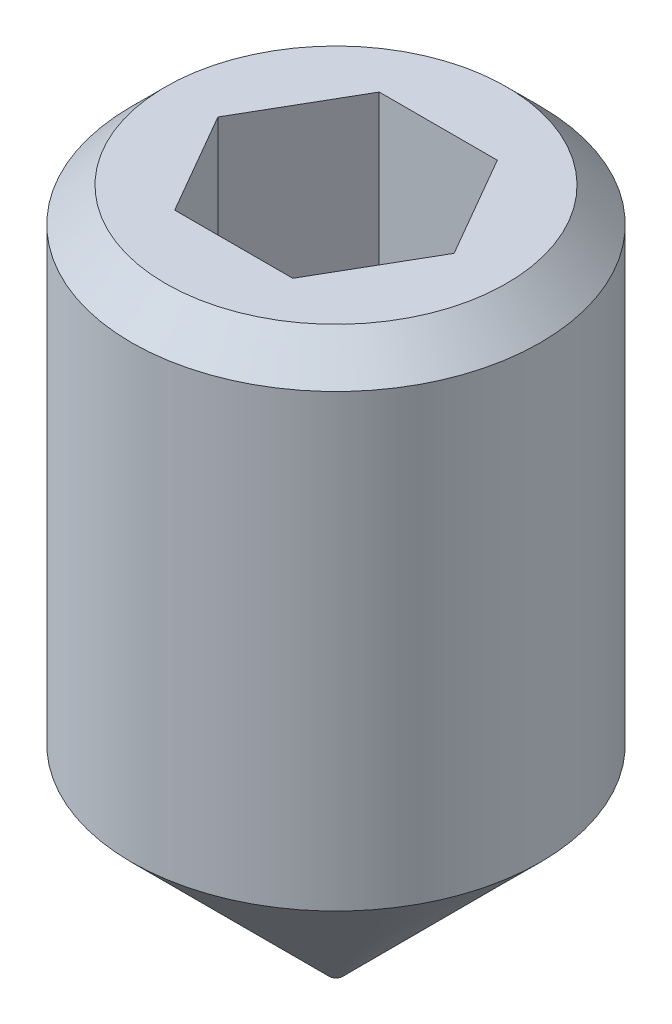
ISO-10303-21;
HEADER;
FILE_DESCRIPTION(('STEP AP214'),'2;1');
FILE_NAME('part.step','',(''),(''),'','','');
FILE_SCHEMA(('AUTOMOTIVE_DESIGN { 1 0 10303 214 1 1 1 1 }'));
ENDSEC;
DATA;
#1=APPLICATION_CONTEXT('core data for automotive mechanical design processes');
#2=APPLICATION_PROTOCOL_DEFINITION('international standard','automotive_design',2000,#1);
#3=PRODUCT_CONTEXT('',#1,'mechanical');
#4=PRODUCT('Part','Part','',(#3));
#5=PRODUCT_RELATED_PRODUCT_CATEGORY('part','',(#4));
#6=PRODUCT_DEFINITION_FORMATION('','',#4);
#7=PRODUCT_DEFINITION_CONTEXT('part definition',#1,'design');
#8=PRODUCT_DEFINITION('design','',#6,#7);
#9=PRODUCT_DEFINITION_SHAPE('','',#8);
#10=(LENGTH_UNIT() NAMED_UNIT(*) SI_UNIT(.MILLI.,.METRE.));
#11=(NAMED_UNIT(*) PLANE_ANGLE_UNIT() SI_UNIT($,.RADIAN.));
#12=(NAMED_UNIT(*) SI_UNIT($,.STERADIAN.) SOLID_ANGLE_UNIT());
#13=UNCERTAINTY_MEASURE_WITH_UNIT(LENGTH_MEASURE(1.E-05),#10,'distance_accuracy_value','');
#14=(GEOMETRIC_REPRESENTATION_CONTEXT(3) GLOBAL_UNCERTAINTY_ASSIGNED_CONTEXT((#13)) GLOBAL_UNIT_ASSIGNED_CONTEXT((#10,
#11,#12)) REPRESENTATION_CONTEXT('',''));
#15=CARTESIAN_POINT('',(0.,0.,0.));
#16=DIRECTION('',(0.,0.,1.));
#17=DIRECTION('',(1.,0.,0.));
#18=AXIS2_PLACEMENT_3D('',#15,#16,#17);
#19=CARTESIAN_POINT('',(0.,5.,0.));
#20=DIRECTION('',(0.,-1.,0.));
#21=DIRECTION('',(0.,0.,-1.));
#22=AXIS2_PLACEMENT_3D('',#19,#20,#21);
#23=CYLINDRICAL_SURFACE('',#22,1.5);
#24=CARTESIAN_POINT('',(0.,4.75,0.));
#25=DIRECTION('',(0.,1.,0.));
#26=DIRECTION('',(0.,0.,1.));
#27=AXIS2_PLACEMENT_3D('',#24,#25,#26);
#28=CIRCLE('',#27,1.5);
#29=CARTESIAN_POINT('',(0.,4.75,1.5));
#30=VERTEX_POINT('',#29);
#31=EDGE_CURVE('E11',#30,#30,#28,.F.);
#32=ORIENTED_EDGE('',*,*,#31,.T.);
#33=EDGE_LOOP('',(#32));
#34=FACE_BOUND('',#33,.T.);
#35=CARTESIAN_POINT('',(0.,1.45,0.));
#36=DIRECTION('',(0.,-1.,0.));
#37=DIRECTION('',(0.,0.,-1.));
#38=AXIS2_PLACEMENT_3D('',#35,#36,#37);
#39=CIRCLE('',#38,1.5);
#40=CARTESIAN_POINT('',(0.,1.45,1.5));
#41=VERTEX_POINT('',#40);
#42=EDGE_CURVE('E192',#41,#41,#39,.T.);
#43=ORIENTED_EDGE('',*,*,#42,.F.);
#44=EDGE_LOOP('',(#43));
#45=FACE_BOUND('',#44,.T.);
#46=ADVANCED_FACE('F35',(#34,#45),#23,.T.);
#47=CARTESIAN_POINT('',(0.,5.,0.));
#48=DIRECTION('',(0.,1.,0.));
#49=DIRECTION('',(0.,0.,1.));
#50=AXIS2_PLACEMENT_3D('',#47,#48,#49);
#51=PLANE('',#50);
#52=CARTESIAN_POINT('',(0.,5.,0.));
#53=DIRECTION('',(0.,1.,0.));
#54=DIRECTION('',(0.,0.,1.));
#55=AXIS2_PLACEMENT_3D('',#52,#53,#54);
#56=CIRCLE('',#55,1.25);
#57=CARTESIAN_POINT('',(0.,5.,1.25));
#58=VERTEX_POINT('',#57);
#59=EDGE_CURVE('E43',#58,#58,#56,.T.);
#60=ORIENTED_EDGE('',*,*,#59,.T.);
#61=EDGE_LOOP('',(#60));
#62=FACE_BOUND('',#61,.T.);
#63=DIRECTION('',(-1.,0.,0.));
#64=VECTOR('',#63,1.);
#65=CARTESIAN_POINT('',(0.433012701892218,5.,0.750000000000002));
#66=LINE('',#65,#64);
#67=CARTESIAN_POINT('',(0.433012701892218,5.,0.750000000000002));
#68=VERTEX_POINT('',#67);
#69=CARTESIAN_POINT('',(-0.433012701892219,5.,0.750000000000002));
#70=VERTEX_POINT('',#69);
#71=EDGE_CURVE('E131',#68,#70,#66,.T.);
#72=ORIENTED_EDGE('',*,*,#71,.T.);
#73=DIRECTION('',(-0.5,0.,-0.866025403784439));
#74=VECTOR('',#73,1.);
#75=CARTESIAN_POINT('',(-0.433012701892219,5.,0.750000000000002));
#76=LINE('',#75,#74);
#77=CARTESIAN_POINT('',(-0.866025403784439,5.,0.));
#78=VERTEX_POINT('',#77);
#79=EDGE_CURVE('E50',#70,#78,#76,.T.);
#80=ORIENTED_EDGE('',*,*,#79,.T.);
#81=DIRECTION('',(0.5,0.,-0.866025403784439));
#82=VECTOR('',#81,1.);
#83=CARTESIAN_POINT('',(-0.866025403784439,5.,0.));
#84=LINE('',#83,#82);
#85=CARTESIAN_POINT('',(-0.433012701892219,5.,-0.75));
#86=VERTEX_POINT('',#85);
#87=EDGE_CURVE('E121',#78,#86,#84,.T.);
#88=ORIENTED_EDGE('',*,*,#87,.T.);
#89=DIRECTION('',(1.,0.,0.));
#90=VECTOR('',#89,1.);
#91=CARTESIAN_POINT('',(-0.433012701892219,5.,-0.75));
#92=LINE('',#91,#90);
#93=CARTESIAN_POINT('',(0.433012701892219,5.,-0.750000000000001));
#94=VERTEX_POINT('',#93);
#95=EDGE_CURVE('E125',#86,#94,#92,.T.);
#96=ORIENTED_EDGE('',*,*,#95,.T.);
#97=DIRECTION('',(0.5,0.,0.866025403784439));
#98=VECTOR('',#97,1.);
#99=CARTESIAN_POINT('',(0.433012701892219,5.,-0.750000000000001));
#100=LINE('',#99,#98);
#101=CARTESIAN_POINT('',(0.866025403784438,5.,0.));
#102=VERTEX_POINT('',#101);
#103=EDGE_CURVE('E128',#94,#102,#100,.T.);
#104=ORIENTED_EDGE('',*,*,#103,.T.);
#105=DIRECTION('',(-0.5,0.,0.866025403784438));
#106=VECTOR('',#105,1.);
#107=CARTESIAN_POINT('',(0.866025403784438,5.,0.));
#108=LINE('',#107,#106);
#109=EDGE_CURVE('E111',#102,#68,#108,.T.);
#110=ORIENTED_EDGE('',*,*,#109,.T.);
#111=EDGE_LOOP('',(#72,#80,#88,#96,#104,#110));
#112=FACE_BOUND('',#111,.T.);
#113=ADVANCED_FACE('F144',(#62,#112),#51,.T.);
#114=CARTESIAN_POINT('',(0.,5.,0.));
#115=DIRECTION('',(0.,-1.,0.));
#116=DIRECTION('',(0.,0.,-1.));
#117=AXIS2_PLACEMENT_3D('',#114,#115,#116);
#118=CONICAL_SURFACE('',#117,1.25,0.785398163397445);
#119=ORIENTED_EDGE('',*,*,#31,.F.);
#120=EDGE_LOOP('',(#119));
#121=FACE_BOUND('',#120,.T.);
#122=ORIENTED_EDGE('',*,*,#59,.F.);
#123=EDGE_LOOP('',(#122));
#124=FACE_BOUND('',#123,.T.);
#125=ADVANCED_FACE('F37',(#121,#124),#118,.T.);
#126=CARTESIAN_POINT('',(-0.433012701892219,3.,0.750000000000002));
#127=DIRECTION('',(0.866025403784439,0.,-0.499999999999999));
#128=DIRECTION('',(-0.5,0.,-0.866025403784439));
#129=AXIS2_PLACEMENT_3D('',#126,#127,#128);
#130=PLANE('',#129);
#131=ORIENTED_EDGE('',*,*,#79,.F.);
#132=DIRECTION('',(0.,1.,0.));
#133=VECTOR('',#132,1.);
#134=CARTESIAN_POINT('',(-0.433012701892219,3.,0.750000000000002));
#135=LINE('',#134,#133);
#136=CARTESIAN_POINT('',(-0.433012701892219,3.,0.750000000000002));
#137=VERTEX_POINT('',#136);
#138=EDGE_CURVE('E116',#137,#70,#135,.T.);
#139=ORIENTED_EDGE('',*,*,#138,.F.);
#140=DIRECTION('',(-0.5,0.,-0.866025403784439));
#141=VECTOR('',#140,1.);
#142=CARTESIAN_POINT('',(-0.433012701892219,3.,0.750000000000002));
#143=LINE('',#142,#141);
#144=CARTESIAN_POINT('',(-0.866025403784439,3.,0.));
#145=VERTEX_POINT('',#144);
#146=EDGE_CURVE('E134',#137,#145,#143,.T.);
#147=ORIENTED_EDGE('',*,*,#146,.T.);
#148=DIRECTION('',(0.,1.,0.));
#149=VECTOR('',#148,1.);
#150=CARTESIAN_POINT('',(-0.866025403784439,3.,0.));
#151=LINE('',#150,#149);
#152=EDGE_CURVE('E140',#145,#78,#151,.T.);
#153=ORIENTED_EDGE('',*,*,#152,.T.);
#154=EDGE_LOOP('',(#131,#139,#147,#153));
#155=FACE_BOUND('',#154,.T.);
#156=ADVANCED_FACE('F148',(#155),#130,.T.);
#157=CARTESIAN_POINT('',(-0.866025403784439,3.,0.));
#158=DIRECTION('',(0.866025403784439,0.,0.5));
#159=DIRECTION('',(0.5,0.,-0.866025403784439));
#160=AXIS2_PLACEMENT_3D('',#157,#158,#159);
#161=PLANE('',#160);
#162=ORIENTED_EDGE('',*,*,#87,.F.);
#163=ORIENTED_EDGE('',*,*,#152,.F.);
#164=DIRECTION('',(0.5,0.,-0.866025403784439));
#165=VECTOR('',#164,1.);
#166=CARTESIAN_POINT('',(-0.866025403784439,3.,0.));
#167=LINE('',#166,#165);
#168=CARTESIAN_POINT('',(-0.433012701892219,3.,-0.75));
#169=VERTEX_POINT('',#168);
#170=EDGE_CURVE('E89',#145,#169,#167,.T.);
#171=ORIENTED_EDGE('',*,*,#170,.T.);
#172=DIRECTION('',(0.,1.,0.));
#173=VECTOR('',#172,1.);
#174=CARTESIAN_POINT('',(-0.433012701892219,3.,-0.75));
#175=LINE('',#174,#173);
#176=EDGE_CURVE('E138',#169,#86,#175,.T.);
#177=ORIENTED_EDGE('',*,*,#176,.T.);
#178=EDGE_LOOP('',(#162,#163,#171,#177));
#179=FACE_BOUND('',#178,.T.);
#180=ADVANCED_FACE('F154',(#179),#161,.T.);
#181=CARTESIAN_POINT('',(-0.433012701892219,3.,-0.75));
#182=DIRECTION('',(0.,0.,1.));
#183=DIRECTION('',(1.,0.,0.));
#184=AXIS2_PLACEMENT_3D('',#181,#182,#183);
#185=PLANE('',#184);
#186=ORIENTED_EDGE('',*,*,#95,.F.);
#187=ORIENTED_EDGE('',*,*,#176,.F.);
#188=DIRECTION('',(1.,0.,0.));
#189=VECTOR('',#188,1.);
#190=CARTESIAN_POINT('',(-0.433012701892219,3.,-0.75));
#191=LINE('',#190,#189);
#192=CARTESIAN_POINT('',(0.433012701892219,3.,-0.750000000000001));
#193=VERTEX_POINT('',#192);
#194=EDGE_CURVE('E107',#169,#193,#191,.T.);
#195=ORIENTED_EDGE('',*,*,#194,.T.);
#196=DIRECTION('',(0.,1.,0.));
#197=VECTOR('',#196,1.);
#198=CARTESIAN_POINT('',(0.433012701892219,3.,-0.750000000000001));
#199=LINE('',#198,#197);
#200=EDGE_CURVE('E104',#193,#94,#199,.T.);
#201=ORIENTED_EDGE('',*,*,#200,.T.);
#202=EDGE_LOOP('',(#186,#187,#195,#201));
#203=FACE_BOUND('',#202,.T.);
#204=ADVANCED_FACE('F171',(#203),#185,.T.);
#205=CARTESIAN_POINT('',(0.433012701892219,3.,-0.750000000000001));
#206=DIRECTION('',(-0.866025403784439,0.,0.5));
#207=DIRECTION('',(0.5,0.,0.866025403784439));
#208=AXIS2_PLACEMENT_3D('',#205,#206,#207);
#209=PLANE('',#208);
#210=ORIENTED_EDGE('',*,*,#103,.F.);
#211=ORIENTED_EDGE('',*,*,#200,.F.);
#212=DIRECTION('',(0.5,0.,0.866025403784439));
#213=VECTOR('',#212,1.);
#214=CARTESIAN_POINT('',(0.433012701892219,3.,-0.750000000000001));
#215=LINE('',#214,#213);
#216=CARTESIAN_POINT('',(0.866025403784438,3.,0.));
#217=VERTEX_POINT('',#216);
#218=EDGE_CURVE('E99',#193,#217,#215,.T.);
#219=ORIENTED_EDGE('',*,*,#218,.T.);
#220=DIRECTION('',(0.,1.,0.));
#221=VECTOR('',#220,1.);
#222=CARTESIAN_POINT('',(0.866025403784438,3.,0.));
#223=LINE('',#222,#221);
#224=EDGE_CURVE('E103',#217,#102,#223,.T.);
#225=ORIENTED_EDGE('',*,*,#224,.T.);
#226=EDGE_LOOP('',(#210,#211,#219,#225));
#227=FACE_BOUND('',#226,.T.);
#228=ADVANCED_FACE('F102',(#227),#209,.T.);
#229=CARTESIAN_POINT('',(0.866025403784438,3.,0.));
#230=DIRECTION('',(-0.866025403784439,0.,-0.5));
#231=DIRECTION('',(-0.5,0.,0.866025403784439));
#232=AXIS2_PLACEMENT_3D('',#229,#230,#231);
#233=PLANE('',#232);
#234=ORIENTED_EDGE('',*,*,#109,.F.);
#235=ORIENTED_EDGE('',*,*,#224,.F.);
#236=DIRECTION('',(-0.5,0.,0.866025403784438));
#237=VECTOR('',#236,1.);
#238=CARTESIAN_POINT('',(0.866025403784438,3.,0.));
#239=LINE('',#238,#237);
#240=CARTESIAN_POINT('',(0.433012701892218,3.,0.750000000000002));
#241=VERTEX_POINT('',#240);
#242=EDGE_CURVE('E106',#217,#241,#239,.T.);
#243=ORIENTED_EDGE('',*,*,#242,.T.);
#244=DIRECTION('',(0.,1.,0.));
#245=VECTOR('',#244,1.);
#246=CARTESIAN_POINT('',(0.433012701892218,3.,0.750000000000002));
#247=LINE('',#246,#245);
#248=EDGE_CURVE('E80',#241,#68,#247,.T.);
#249=ORIENTED_EDGE('',*,*,#248,.T.);
#250=EDGE_LOOP('',(#234,#235,#243,#249));
#251=FACE_BOUND('',#250,.T.);
#252=ADVANCED_FACE('F109',(#251),#233,.T.);
#253=CARTESIAN_POINT('',(0.433012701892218,3.,0.750000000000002));
#254=DIRECTION('',(0.,0.,-1.));
#255=DIRECTION('',(-1.,0.,0.));
#256=AXIS2_PLACEMENT_3D('',#253,#254,#255);
#257=PLANE('',#256);
#258=ORIENTED_EDGE('',*,*,#71,.F.);
#259=ORIENTED_EDGE('',*,*,#248,.F.);
#260=DIRECTION('',(-1.,0.,0.));
#261=VECTOR('',#260,1.);
#262=CARTESIAN_POINT('',(0.433012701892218,3.,0.750000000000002));
#263=LINE('',#262,#261);
#264=EDGE_CURVE('E58',#241,#137,#263,.T.);
#265=ORIENTED_EDGE('',*,*,#264,.T.);
#266=ORIENTED_EDGE('',*,*,#138,.T.);
#267=EDGE_LOOP('',(#258,#259,#265,#266));
#268=FACE_BOUND('',#267,.T.);
#269=ADVANCED_FACE('F180',(#268),#257,.T.);
#270=CARTESIAN_POINT('',(-1.29903810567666,3.,-0.75));
#271=DIRECTION('',(0.,-1.,0.));
#272=DIRECTION('',(0.,0.,-1.));
#273=AXIS2_PLACEMENT_3D('',#270,#271,#272);
#274=PLANE('',#273);
#275=ORIENTED_EDGE('',*,*,#146,.F.);
#276=ORIENTED_EDGE('',*,*,#264,.F.);
#277=ORIENTED_EDGE('',*,*,#242,.F.);
#278=ORIENTED_EDGE('',*,*,#218,.F.);
#279=ORIENTED_EDGE('',*,*,#194,.F.);
#280=ORIENTED_EDGE('',*,*,#170,.F.);
#281=EDGE_LOOP('',(#275,#276,#277,#278,#279,#280));
#282=FACE_BOUND('',#281,.T.);
#283=ADVANCED_FACE('F114',(#282),#274,.F.);
#284=CARTESIAN_POINT('',(0.,0.,0.));
#285=DIRECTION('',(0.,1.,0.));
#286=DIRECTION('',(0.,0.,1.));
#287=AXIS2_PLACEMENT_3D('',#284,#285,#286);
#288=CONICAL_SURFACE('',#287,0.0499999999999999,0.78539816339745);
#289=CARTESIAN_POINT('',(0.,0.,0.));
#290=DIRECTION('',(0.,-1.,0.));
#291=DIRECTION('',(0.,0.,-1.));
#292=AXIS2_PLACEMENT_3D('',#289,#290,#291);
#293=CIRCLE('',#292,0.0499999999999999);
#294=CARTESIAN_POINT('',(0.,0.,0.0499999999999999));
#295=VERTEX_POINT('',#294);
#296=EDGE_CURVE('E122',#295,#295,#293,.T.);
#297=CARTESIAN_POINT('',(0.,1.45,1.5));
#298=CARTESIAN_POINT('',(0.,1.43489583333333,1.48489583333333));
#299=CARTESIAN_POINT('',(0.,1.41979166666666,1.46979166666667));
#300=CARTESIAN_POINT('',(0.,1.38958333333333,1.43958333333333));
#301=CARTESIAN_POINT('',(0.,1.37447916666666,1.42447916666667));
#302=CARTESIAN_POINT('',(0.,1.34427083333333,1.39427083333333));
#303=CARTESIAN_POINT('',(0.,1.32916666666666,1.37916666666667));
#304=CARTESIAN_POINT('',(0.,1.29895833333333,1.34895833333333));
#305=CARTESIAN_POINT('',(0.,1.28385416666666,1.33385416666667));
#306=CARTESIAN_POINT('',(0.,1.25364583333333,1.30364583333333));
#307=CARTESIAN_POINT('',(0.,1.23854166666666,1.28854166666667));
#308=CARTESIAN_POINT('',(0.,1.20833333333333,1.25833333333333));
#309=CARTESIAN_POINT('',(0.,1.19322916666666,1.24322916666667));
#310=CARTESIAN_POINT('',(0.,1.16302083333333,1.21302083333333));
#311=CARTESIAN_POINT('',(0.,1.14791666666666,1.19791666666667));
#312=CARTESIAN_POINT('',(0.,1.11770833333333,1.16770833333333));
#313=CARTESIAN_POINT('',(0.,1.10260416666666,1.15260416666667));
#314=CARTESIAN_POINT('',(0.,1.07239583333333,1.12239583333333));
#315=CARTESIAN_POINT('',(0.,1.05729166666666,1.10729166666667));
#316=CARTESIAN_POINT('',(0.,1.02708333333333,1.07708333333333));
#317=CARTESIAN_POINT('',(0.,1.01197916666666,1.06197916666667));
#318=CARTESIAN_POINT('',(0.,0.98177083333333,1.03177083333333));
#319=CARTESIAN_POINT('',(0.,0.966666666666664,1.01666666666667));
#320=CARTESIAN_POINT('',(0.,0.93645833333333,0.986458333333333));
#321=CARTESIAN_POINT('',(0.,0.921354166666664,0.971354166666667));
#322=CARTESIAN_POINT('',(0.,0.89114583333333,0.941145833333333));
#323=CARTESIAN_POINT('',(0.,0.876041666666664,0.926041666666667));
#324=CARTESIAN_POINT('',(0.,0.845833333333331,0.895833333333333));
#325=CARTESIAN_POINT('',(0.,0.830729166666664,0.880729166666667));
#326=CARTESIAN_POINT('',(0.,0.800520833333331,0.850520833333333));
#327=CARTESIAN_POINT('',(0.,0.785416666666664,0.835416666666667));
#328=CARTESIAN_POINT('',(0.,0.755208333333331,0.805208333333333));
#329=CARTESIAN_POINT('',(0.,0.740104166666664,0.790104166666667));
#330=CARTESIAN_POINT('',(0.,0.709895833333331,0.759895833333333));
#331=CARTESIAN_POINT('',(0.,0.694791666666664,0.744791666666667));
#332=CARTESIAN_POINT('',(0.,0.664583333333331,0.714583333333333));
#333=CARTESIAN_POINT('',(0.,0.649479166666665,0.699479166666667));
#334=CARTESIAN_POINT('',(0.,0.619270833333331,0.669270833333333));
#335=CARTESIAN_POINT('',(0.,0.604166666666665,0.654166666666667));
#336=CARTESIAN_POINT('',(0.,0.573958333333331,0.623958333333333));
#337=CARTESIAN_POINT('',(0.,0.558854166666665,0.608854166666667));
#338=CARTESIAN_POINT('',(0.,0.528645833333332,0.578645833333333));
#339=CARTESIAN_POINT('',(0.,0.513541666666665,0.563541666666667));
#340=CARTESIAN_POINT('',(0.,0.483333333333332,0.533333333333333));
#341=CARTESIAN_POINT('',(0.,0.468229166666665,0.518229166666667));
#342=CARTESIAN_POINT('',(0.,0.438020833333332,0.488020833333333));
#343=CARTESIAN_POINT('',(0.,0.422916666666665,0.472916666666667));
#344=CARTESIAN_POINT('',(0.,0.392708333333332,0.442708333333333));
#345=CARTESIAN_POINT('',(0.,0.377604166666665,0.427604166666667));
#346=CARTESIAN_POINT('',(0.,0.347395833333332,0.397395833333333));
#347=CARTESIAN_POINT('',(0.,0.332291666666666,0.382291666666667));
#348=CARTESIAN_POINT('',(0.,0.302083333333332,0.352083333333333));
#349=CARTESIAN_POINT('',(0.,0.286979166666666,0.336979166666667));
#350=CARTESIAN_POINT('',(0.,0.256770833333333,0.306770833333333));
#351=CARTESIAN_POINT('',(0.,0.241666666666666,0.291666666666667));
#352=CARTESIAN_POINT('',(0.,0.211458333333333,0.261458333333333));
#353=CARTESIAN_POINT('',(0.,0.196354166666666,0.246354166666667));
#354=CARTESIAN_POINT('',(0.,0.166145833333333,0.216145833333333));
#355=CARTESIAN_POINT('',(0.,0.151041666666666,0.201041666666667));
#356=CARTESIAN_POINT('',(0.,0.120833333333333,0.170833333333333));
#357=CARTESIAN_POINT('',(0.,0.105729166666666,0.155729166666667));
#358=CARTESIAN_POINT('',(0.,0.0755208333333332,0.125520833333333));
#359=CARTESIAN_POINT('',(0.,0.0604166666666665,0.110416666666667));
#360=CARTESIAN_POINT('',(0.,0.0302083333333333,0.0802083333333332));
#361=CARTESIAN_POINT('',(0.,0.0151041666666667,0.0651041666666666));
#362=CARTESIAN_POINT('',(0.,0.,0.0499999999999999));
#363=B_SPLINE_CURVE_WITH_KNOTS('',3,(#297,#298,#299,#300,#301,#302,#303,#304,#305,#306,#307,
#308,#309,#310,#311,#312,#313,#314,#315,#316,#317,#318,#319,#320,#321,#322,#323,#324,#325,#326,
#327,#328,#329,#330,#331,#332,#333,#334,#335,#336,#337,#338,#339,#340,#341,#342,#343,#344,#345,
#346,#347,#348,#349,#350,#351,#352,#353,#354,#355,#356,#357,#358,#359,#360,#361,#362),
.UNSPECIFIED.,.F.,.F.,(4,2,2,2,2,2,2,2,2,2,2,2,2,2,2,2,2,2,2,2,2,2,2,2,2,2,2,2,2,2,2,2,4),(0.,
0.0640815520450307,0.128163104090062,0.192244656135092,0.256326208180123,0.320407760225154,
0.384489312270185,0.448570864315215,0.512652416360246,0.576733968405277,0.640815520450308,
0.704897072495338,0.768978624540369,0.8330601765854,0.897141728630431,0.961223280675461,
1.02530483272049,1.08938638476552,1.15346793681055,1.21754948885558,1.28163104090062,
1.34571259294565,1.40979414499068,1.47387569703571,1.53795724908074,1.60203880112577,
1.6661203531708,1.73020190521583,1.79428345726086,1.85836500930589,1.92244656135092,
1.98652811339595,2.05060966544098),.UNSPECIFIED.);
#364=EDGE_CURVE('BSEAM166',#41,#295,#363,.T.);
#365=ORIENTED_EDGE('',*,*,#42,.T.);
#366=ORIENTED_EDGE('',*,*,#296,.F.);
#367=ORIENTED_EDGE('',*,*,#364,.T.);
#368=ORIENTED_EDGE('',*,*,#364,.F.);
#369=EDGE_LOOP('',(#365,#367,#366,#368));
#370=FACE_BOUND('',#369,.T.);
#371=ADVANCED_FACE('F166',(#370),#288,.T.);
#372=CARTESIAN_POINT('',(0.,0.,0.));
#373=DIRECTION('',(0.,1.,0.));
#374=DIRECTION('',(0.,0.,1.));
#375=AXIS2_PLACEMENT_3D('',#372,#373,#374);
#376=PLANE('',#375);
#377=ORIENTED_EDGE('',*,*,#296,.T.);
#378=EDGE_LOOP('',(#377));
#379=FACE_BOUND('',#378,.T.);
#380=ADVANCED_FACE('F164',(#379),#376,.F.);
#381=CLOSED_SHELL('',(#46,#113,#125,#156,#180,#204,#228,#252,#269,#283,#371,#380));
#382=MANIFOLD_SOLID_BREP('B2',#381);
#383=ADVANCED_BREP_SHAPE_REPRESENTATION('',(#18,#382),#14);
#384=SHAPE_DEFINITION_REPRESENTATION(#9,#383);
ENDSEC;
END-ISO-10303-21;
